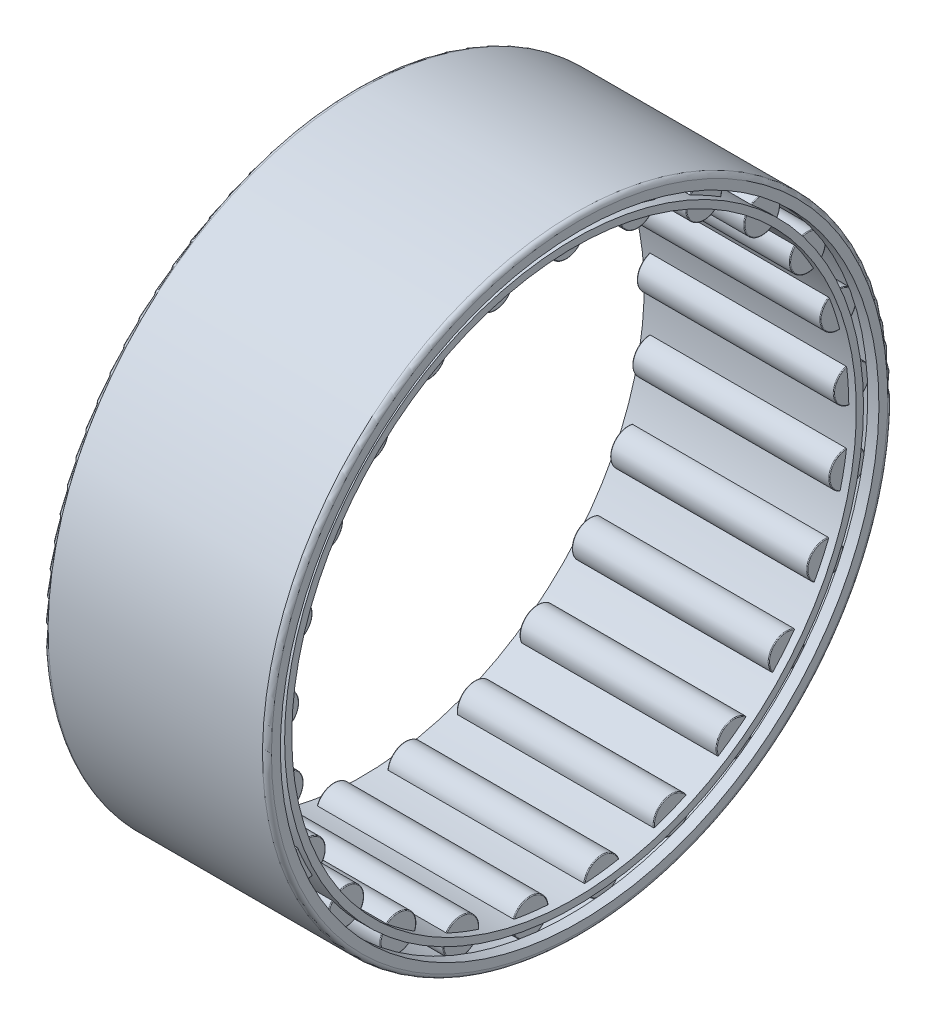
from build123d import *

# Parameters (mm, degrees)
CAGSPISKE_W           = 30.1625
CAGSPISKE_H           = 1.0162
ROLLERSDETAILED_COUNT = 25
ROLLERSDETAILED_ANGLE = 345.6


with BuildPart() as part:
    # InnRacSke → Race (revolve)
    with BuildSketch(Plane.XY):
        with BuildLine():
            Line((-14.2875, 42.545), (-15.875, 42.545))
            Line((-15.875, 42.545), (-15.875, 43.815))
            ThreePointArc((-15.875, 43.815), (-15.689012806, 44.264012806), (-15.24, 44.45))
            Line((-15.24, 44.45), (15.24, 44.45))
            ThreePointArc((15.24, 44.45), (15.689012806, 44.264012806), (15.875, 43.815))
            Line((15.875, 43.815), (15.875, 42.545))
            Line((15.875, 42.545), (14.2875, 42.545))
            Line((14.2875, 42.545), (14.2875, 43.18))
            Line((14.2875, 43.18), (-14.2875, 43.18))
            Line((-14.2875, 43.18), (-14.2875, 42.545))
        make_face()
    revolve(axis=Axis((-31.75, 0, 0), (1, 0, 0)))

    # RolDetSke → RollerDetailed (revolve)
    with BuildSketch(Plane.XY, mode=Mode.PRIVATE) as rollerdetailed_sk:
        with BuildLine():
            Line((-14.00175, 43.07888), (-14.00175, 40.64))
            Line((-14.00175, 40.64), (14.00175, 40.64))
            Line((14.00175, 40.64), (14.00175, 43.07888))
            ThreePointArc((14.00175, 43.07888), (13.971986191, 43.150736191), (13.90013, 43.1805))
            Line((13.90013, 43.1805), (-13.90013, 43.1805))
            ThreePointArc((-13.90013, 43.1805), (-13.971986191, 43.150736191), (-14.00175, 43.07888))
        make_face()
    rollerdetailed = revolve(rollerdetailed_sk.sketch.rotate(Axis((-28.575, 40.64, 0), (1, 0, 0)), 270), axis=Axis((-28.575, 40.64, 0), (1, 0, 0)))

    # CagSpiSke → CageSpine (revolve)
    with BuildSketch(Plane.XY, mode=Mode.PRIVATE) as cagespine_sk:
        with Locations((0, 40.64)):
            Rectangle(CAGSPISKE_W, CAGSPISKE_H)
    revolve(cagespine_sk.sketch.rotate(Axis((-31.75, 0, 0), (1, 0, 0)), 90), axis=Axis((-31.75, 0, 0), (1, 0, 0)))

    # RollersDetailed: RollerDetailed ×25 about axis
    rollersdetailed_axis = Axis((-50, 0, 0), (1, 0, 0))
    for i in range(1, ROLLERSDETAILED_COUNT):
        add(rollerdetailed.rotate(rollersdetailed_axis, i * ROLLERSDETAILED_ANGLE / (ROLLERSDETAILED_COUNT - 1)))


solid = part.part
